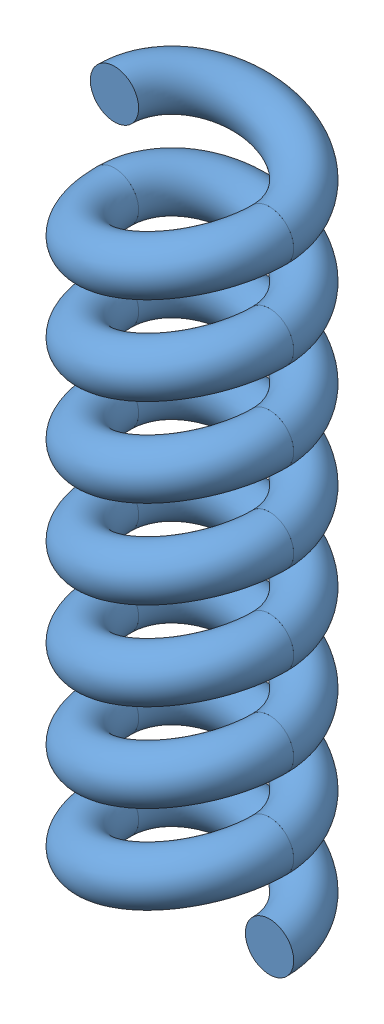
SolidWorks assembly Feder_rund_gekuerzt.SLDASM, configuration Standard (file format 4100). Lengths in mm.
Overall size (2 6.71 1.95).
15 component instances, 1 part files, 48 mates.
Components (placement in the parent):
- Feder_rund_gekuerzt-1: Feder_rund_gekuerzt.SLDPRT [flexible Feder Windungen] at (-0.0615 -0.0114 0) x (0.961919 -0.273333 0) z (0 0 1) size (1.95 0.45 0.97)
- Feder_rund_gekuerzt-2: Feder_rund_gekuerzt.SLDPRT [flexible Feder Windungen] at (0.0615 0.3986 0) x (-0.961919 -0.273333 0) z (0 0 -1) size (1.95 0.45 0.97)
- Feder_rund_gekuerzt-3: Feder_rund_gekuerzt.SLDPRT [flexible Feder Windungen] at (-0.0615 0.8086 0) x (0.961919 -0.273333 0) z (0 0 1) size (1.95 0.45 0.97)
- Feder_rund_gekuerzt-4: Feder_rund_gekuerzt.SLDPRT [flexible Feder Windungen] at (0.0615 1.2186 0) x (-0.961919 -0.273333 0) z (0 0 -1) size (1.95 0.45 0.97)
- Feder_rund_gekuerzt-5: Feder_rund_gekuerzt.SLDPRT [flexible Feder Windungen] at (-0.0615 1.6286 0) x (0.961919 -0.273333 0) z (0 0 1) size (1.95 0.45 0.97)
- Feder_rund_gekuerzt-6: Feder_rund_gekuerzt.SLDPRT [flexible Feder Windungen] at (0.0615 2.0386 0) x (-0.961919 -0.273333 0) z (0 0 -1) size (1.95 0.45 0.97)
- Feder_rund_gekuerzt-7: Feder_rund_gekuerzt.SLDPRT [flexible Feder Windungen] at (-0.0615 2.4486 0) x (0.961919 -0.273333 0) z (0 0 1) size (1.95 0.45 0.97)
- Feder_rund_gekuerzt-8: Feder_rund_gekuerzt.SLDPRT [flexible Feder Windungen] at (0.0615 2.8586 0) x (-0.961919 -0.273333 0) z (0 0 -1) size (1.95 0.45 0.97)
- Feder_rund_gekuerzt-9: Feder_rund_gekuerzt.SLDPRT [flexible Feder Windungen] at (-0.0615 3.2686 0) x (0.961919 -0.273333 0) z (0 0 1) size (1.95 0.45 0.97)
- Feder_rund_gekuerzt-10: Feder_rund_gekuerzt.SLDPRT [flexible Feder Windungen] at (0.0615 3.6786 0) x (-0.961919 -0.273333 0) z (0 0 -1) size (1.95 0.45 0.97)
- Feder_rund_gekuerzt-11: Feder_rund_gekuerzt.SLDPRT [flexible Feder Windungen] at (-0.0615 4.0886 0) x (0.961919 -0.273333 0) z (0 0 1) size (1.95 0.45 0.97)
- Feder_rund_gekuerzt-12: Feder_rund_gekuerzt.SLDPRT [flexible Feder Windungen] at (0.0615 4.4986 0) x (-0.961919 -0.273333 0) z (0 0 -1) size (1.95 0.45 0.97)
- Feder_rund_gekuerzt-13: Feder_rund_gekuerzt.SLDPRT [flexible Feder Windungen] at (-0.0615 4.9086 0) x (0.961919 -0.273333 0) z (0 0 1) size (1.95 0.45 0.97)
- Feder_rund_gekuerzt-14: Feder_rund_gekuerzt.SLDPRT [flexible Feder Windungen] at (0.0615 5.3186 0) x (-0.961919 -0.273333 0) z (0 0 -1) size (1.95 0.45 0.97)
- Feder_rund_gekuerzt-15: Feder_rund_gekuerzt.SLDPRT [flexible Feder Windungen] at (-0.0615 5.7286 0) x (0.961919 -0.273333 0) z (0 0 1) size (1.95 0.45 0.97)
Mates (geometry in assembly coordinates):
- Feder unten fixieren: coincident: point of Feder_rund_gekuerzt-1; plane of assembly
- Deckungsgleich1: unknown anti-aligned: plane of Feder_rund_gekuerzt-1 through (-0.7214 0.41 0) normal (0 0 1); plane of Feder_rund_gekuerzt-2 through (-0.7214 0.41 0) normal (0 0 -1)
- Deckungsgleich2: unknown aligned: circle of Feder_rund_gekuerzt-1; circle of Feder_rund_gekuerzt-2
- Feder senkrecht halten Punkt 1: unknown: unknown of Feder_rund_gekuerzt-2
- Deckungsgleich3: unknown anti-aligned: plane of Feder_rund_gekuerzt-2 through (0.7214 0.82 0) normal (0 0 -1); plane of Feder_rund_gekuerzt-3 through (0.7214 0.82 0) normal (0 0 1)
- Deckungsgleich4: unknown aligned: circle of Feder_rund_gekuerzt-2; circle of Feder_rund_gekuerzt-3
- Feder senkrecht halten Punkt 2: unknown: unknown of Feder_rund_gekuerzt-3
- Axialbewegung der Feder einschränken: unknown aligned: plane of Feder_rund_gekuerzt-3 through (-0.0615 0.8086 0) normal (0 0 1)
- Deckungsgleich5: unknown anti-aligned: plane of Feder_rund_gekuerzt-3 through (-0.7214 1.23 0) normal (0 0 1); plane of Feder_rund_gekuerzt-4 through (-0.7214 1.23 0) normal (0 0 -1)
- Deckungsgleich6: unknown aligned: circle of Feder_rund_gekuerzt-3; circle of Feder_rund_gekuerzt-4
- Deckungsgleich7: unknown anti-aligned: plane of Feder_rund_gekuerzt-4 through (0.7214 1.64 0) normal (0 0 -1); plane of Feder_rund_gekuerzt-5 through (0.7214 1.64 0) normal (0 0 1)
- Deckungsgleich8: unknown aligned: circle of Feder_rund_gekuerzt-4; circle of Feder_rund_gekuerzt-5
- Limits der Feder: limit distance = 0.82 mm: point of Feder_rund_gekuerzt-3; point of Feder_rund_gekuerzt-5
- Deckungsgleich9: unknown anti-aligned: plane of Feder_rund_gekuerzt-5 through (-0.7214 2.05 0) normal (0 0 1); plane of Feder_rund_gekuerzt-6 through (-0.7214 2.05 0) normal (0 0 -1)
- Deckungsgleich10: unknown aligned: circle of Feder_rund_gekuerzt-5; circle of Feder_rund_gekuerzt-6
- Deckungsgleich11: unknown anti-aligned: plane of Feder_rund_gekuerzt-6 through (0.7214 2.46 0) normal (0 0 -1); plane of Feder_rund_gekuerzt-7 through (0.7214 2.46 0) normal (0 0 1)
- Deckungsgleich12: unknown aligned: circle of Feder_rund_gekuerzt-6; circle of Feder_rund_gekuerzt-7
- Deckungsgleich13: unknown anti-aligned: plane of Feder_rund_gekuerzt-7 through (-0.7214 2.87 0) normal (0 0 1); plane of Feder_rund_gekuerzt-8 through (-0.7214 2.87 0) normal (0 0 -1)
- Deckungsgleich14: unknown aligned: circle of Feder_rund_gekuerzt-7; circle of Feder_rund_gekuerzt-8
- Deckungsgleich15: unknown anti-aligned: plane of Feder_rund_gekuerzt-8 through (0.7214 3.28 0) normal (0 0 -1); plane of Feder_rund_gekuerzt-9 through (0.7214 3.28 0) normal (0 0 1)
- Deckungsgleich16: unknown aligned: circle of Feder_rund_gekuerzt-8; circle of Feder_rund_gekuerzt-9
- Deckungsgleich17: unknown anti-aligned: plane of Feder_rund_gekuerzt-9 through (-0.7214 3.69 0) normal (0 0 1); plane of Feder_rund_gekuerzt-10 through (-0.7214 3.69 0) normal (0 0 -1)
- Deckungsgleich18: unknown aligned: circle of Feder_rund_gekuerzt-9; circle of Feder_rund_gekuerzt-10
- Deckungsgleich19: unknown anti-aligned: plane of Feder_rund_gekuerzt-10 through (0.7214 4.1 0) normal (0 0 -1); plane of Feder_rund_gekuerzt-11 through (0.7214 4.1 0) normal (0 0 1)
- Deckungsgleich20: unknown aligned: circle of Feder_rund_gekuerzt-10; circle of Feder_rund_gekuerzt-11
- Deckungsgleich21: unknown anti-aligned: plane of Feder_rund_gekuerzt-11 through (-0.7214 4.51 0) normal (0 0 1); plane of Feder_rund_gekuerzt-12 through (-0.7214 4.51 0) normal (0 0 -1)
- Deckungsgleich22: unknown aligned: circle of Feder_rund_gekuerzt-11; circle of Feder_rund_gekuerzt-12
- Deckungsgleich23: unknown anti-aligned: plane of Feder_rund_gekuerzt-12 through (0.7214 4.92 0) normal (0 0 -1); plane of Feder_rund_gekuerzt-13 through (0.7214 4.92 0) normal (0 0 1)
- Deckungsgleich24: unknown aligned: circle of Feder_rund_gekuerzt-12; circle of Feder_rund_gekuerzt-13
- Deckungsgleich25: unknown anti-aligned: plane of Feder_rund_gekuerzt-13 through (-0.7214 5.33 0) normal (0 0 1); plane of Feder_rund_gekuerzt-14 through (-0.7214 5.33 0) normal (0 0 -1)
- Deckungsgleich26: unknown aligned: circle of Feder_rund_gekuerzt-13; circle of Feder_rund_gekuerzt-14
- Deckungsgleich27: unknown anti-aligned: plane of Feder_rund_gekuerzt-14 through (0.7214 5.74 0) normal (0 0 -1); plane of Feder_rund_gekuerzt-15 through (0.7214 5.74 0) normal (0 0 1)
- Deckungsgleich28: unknown aligned: circle of Feder_rund_gekuerzt-14; circle of Feder_rund_gekuerzt-15
- Parallel1: parallel aligned: plane of Feder_rund_gekuerzt-1; plane of Feder_rund_gekuerzt-3
- Parallel2: parallel aligned: plane of Feder_rund_gekuerzt-2; plane of Feder_rund_gekuerzt-4
- Parallel3: parallel aligned: plane of Feder_rund_gekuerzt-3; plane of Feder_rund_gekuerzt-5
- Parallel4: parallel aligned: plane of Feder_rund_gekuerzt-4; plane of Feder_rund_gekuerzt-6
- Parallel5: parallel aligned: plane of Feder_rund_gekuerzt-5; plane of Feder_rund_gekuerzt-7
- Parallel6: parallel aligned: plane of Feder_rund_gekuerzt-6; plane of Feder_rund_gekuerzt-8
- Parallel7: parallel aligned: plane of Feder_rund_gekuerzt-7; plane of Feder_rund_gekuerzt-9
- Parallel8: parallel aligned: plane of Feder_rund_gekuerzt-8; plane of Feder_rund_gekuerzt-10
- Parallel9: parallel aligned: plane of Feder_rund_gekuerzt-9; plane of Feder_rund_gekuerzt-11
- Parallel10: parallel aligned: plane of Feder_rund_gekuerzt-10; plane of Feder_rund_gekuerzt-12
- Parallel11: parallel aligned: plane of Feder_rund_gekuerzt-11; plane of Feder_rund_gekuerzt-13
- Parallel12: parallel aligned: plane of Feder_rund_gekuerzt-12; plane of Feder_rund_gekuerzt-14
- Parallel13: parallel aligned: unknown of Feder_rund_gekuerzt-13; unknown of Feder_rund_gekuerzt-15
- Hilfsebene Anfang: unknown = 0.225 mm: unknown of Feder_rund_gekuerzt-1
- Hilfsebene Ende: unknown = 0.225 mm: unknown of Feder_rund_gekuerzt-15
